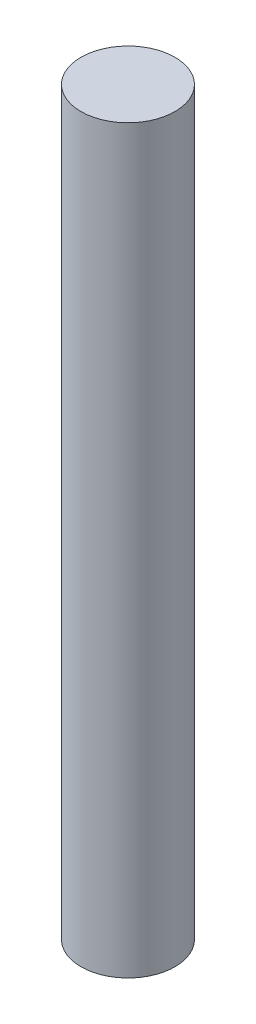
ISO-10303-21;
HEADER;
FILE_DESCRIPTION(('STEP AP214'),'2;1');
FILE_NAME('part.step','',(''),(''),'','','');
FILE_SCHEMA(('AUTOMOTIVE_DESIGN { 1 0 10303 214 1 1 1 1 }'));
ENDSEC;
DATA;
#1=APPLICATION_CONTEXT('core data for automotive mechanical design processes');
#2=APPLICATION_PROTOCOL_DEFINITION('international standard','automotive_design',2000,#1);
#3=PRODUCT_CONTEXT('',#1,'mechanical');
#4=PRODUCT('Part','Part','',(#3));
#5=PRODUCT_RELATED_PRODUCT_CATEGORY('part','',(#4));
#6=PRODUCT_DEFINITION_FORMATION('','',#4);
#7=PRODUCT_DEFINITION_CONTEXT('part definition',#1,'design');
#8=PRODUCT_DEFINITION('design','',#6,#7);
#9=PRODUCT_DEFINITION_SHAPE('','',#8);
#10=(LENGTH_UNIT() NAMED_UNIT(*) SI_UNIT(.MILLI.,.METRE.));
#11=(NAMED_UNIT(*) PLANE_ANGLE_UNIT() SI_UNIT($,.RADIAN.));
#12=(NAMED_UNIT(*) SI_UNIT($,.STERADIAN.) SOLID_ANGLE_UNIT());
#13=UNCERTAINTY_MEASURE_WITH_UNIT(LENGTH_MEASURE(1.E-05),#10,'distance_accuracy_value','');
#14=(GEOMETRIC_REPRESENTATION_CONTEXT(3) GLOBAL_UNCERTAINTY_ASSIGNED_CONTEXT((#13)) GLOBAL_UNIT_ASSIGNED_CONTEXT((#10,
#11,#12)) REPRESENTATION_CONTEXT('',''));
#15=CARTESIAN_POINT('',(0.,0.,0.));
#16=DIRECTION('',(0.,0.,1.));
#17=DIRECTION('',(1.,0.,0.));
#18=AXIS2_PLACEMENT_3D('',#15,#16,#17);
#19=CARTESIAN_POINT('',(0.,100.,0.));
#20=DIRECTION('',(0.,-1.,0.));
#21=DIRECTION('',(0.,0.,-1.));
#22=AXIS2_PLACEMENT_3D('',#19,#20,#21);
#23=CYLINDRICAL_SURFACE('',#22,6.35);
#24=CARTESIAN_POINT('',(0.,100.,0.));
#25=DIRECTION('',(0.,1.,0.));
#26=DIRECTION('',(0.,0.,1.));
#27=AXIS2_PLACEMENT_3D('',#24,#25,#26);
#28=CIRCLE('',#27,6.35);
#29=CARTESIAN_POINT('',(0.,100.,6.35));
#30=VERTEX_POINT('',#29);
#31=EDGE_CURVE('E10',#30,#30,#28,.T.);
#32=ORIENTED_EDGE('',*,*,#31,.F.);
#33=EDGE_LOOP('',(#32));
#34=FACE_BOUND('',#33,.T.);
#35=CARTESIAN_POINT('',(0.,0.,0.));
#36=DIRECTION('',(0.,1.,0.));
#37=DIRECTION('',(0.,0.,1.));
#38=AXIS2_PLACEMENT_3D('',#35,#36,#37);
#39=CIRCLE('',#38,6.35);
#40=CARTESIAN_POINT('',(0.,0.,6.35));
#41=VERTEX_POINT('',#40);
#42=EDGE_CURVE('E46',#41,#41,#39,.T.);
#43=ORIENTED_EDGE('',*,*,#42,.T.);
#44=EDGE_LOOP('',(#43));
#45=FACE_BOUND('',#44,.T.);
#46=ADVANCED_FACE('F43',(#34,#45),#23,.T.);
#47=CARTESIAN_POINT('',(0.,100.,0.));
#48=DIRECTION('',(0.,1.,0.));
#49=DIRECTION('',(0.,0.,1.));
#50=AXIS2_PLACEMENT_3D('',#47,#48,#49);
#51=PLANE('',#50);
#52=ORIENTED_EDGE('',*,*,#31,.T.);
#53=EDGE_LOOP('',(#52));
#54=FACE_BOUND('',#53,.T.);
#55=ADVANCED_FACE('F60',(#54),#51,.T.);
#56=CARTESIAN_POINT('',(0.,0.,0.));
#57=DIRECTION('',(0.,1.,0.));
#58=DIRECTION('',(0.,0.,1.));
#59=AXIS2_PLACEMENT_3D('',#56,#57,#58);
#60=PLANE('',#59);
#61=ORIENTED_EDGE('',*,*,#42,.F.);
#62=EDGE_LOOP('',(#61));
#63=FACE_BOUND('',#62,.T.);
#64=ADVANCED_FACE('F58',(#63),#60,.F.);
#65=CLOSED_SHELL('',(#46,#55,#64));
#66=MANIFOLD_SOLID_BREP('B2',#65);
#67=ADVANCED_BREP_SHAPE_REPRESENTATION('',(#18,#66),#14);
#68=SHAPE_DEFINITION_REPRESENTATION(#9,#67);
ENDSEC;
END-ISO-10303-21;
